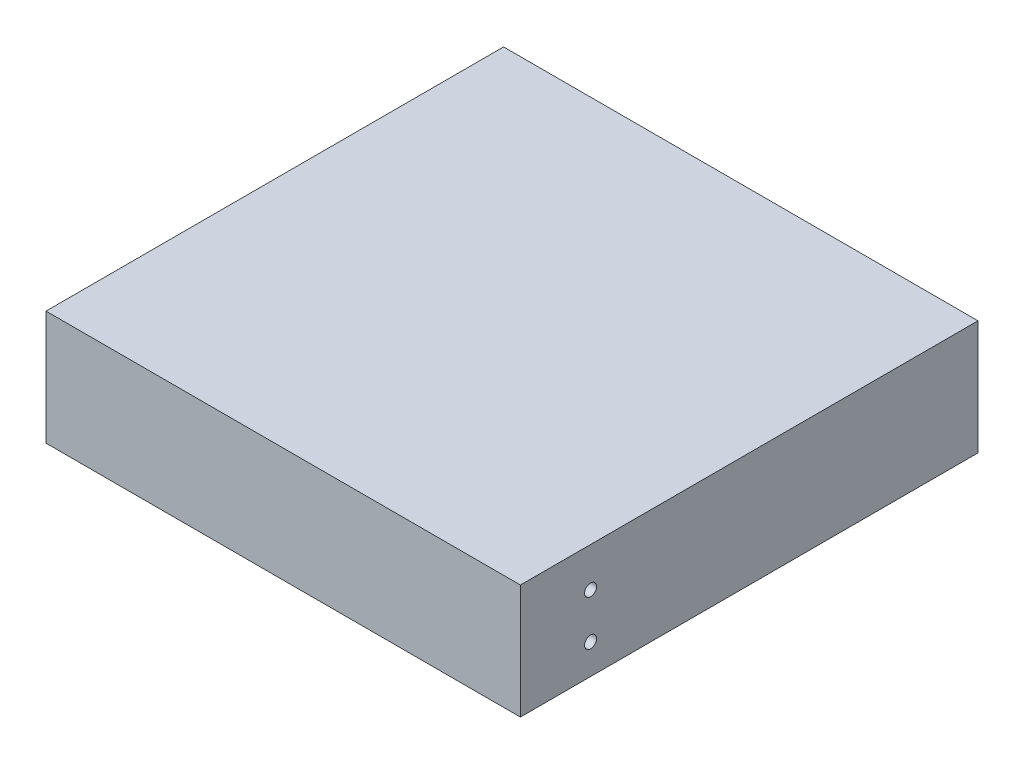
ISO-10303-21;
HEADER;
FILE_DESCRIPTION(('STEP AP214'),'2;1');
FILE_NAME('part.step','',(''),(''),'','','');
FILE_SCHEMA(('AUTOMOTIVE_DESIGN { 1 0 10303 214 1 1 1 1 }'));
ENDSEC;
DATA;
#1=APPLICATION_CONTEXT('core data for automotive mechanical design processes');
#2=APPLICATION_PROTOCOL_DEFINITION('international standard','automotive_design',2000,#1);
#3=PRODUCT_CONTEXT('',#1,'mechanical');
#4=PRODUCT('Part','Part','',(#3));
#5=PRODUCT_RELATED_PRODUCT_CATEGORY('part','',(#4));
#6=PRODUCT_DEFINITION_FORMATION('','',#4);
#7=PRODUCT_DEFINITION_CONTEXT('part definition',#1,'design');
#8=PRODUCT_DEFINITION('design','',#6,#7);
#9=PRODUCT_DEFINITION_SHAPE('','',#8);
#10=(LENGTH_UNIT() NAMED_UNIT(*) SI_UNIT(.MILLI.,.METRE.));
#11=(NAMED_UNIT(*) PLANE_ANGLE_UNIT() SI_UNIT($,.RADIAN.));
#12=(NAMED_UNIT(*) SI_UNIT($,.STERADIAN.) SOLID_ANGLE_UNIT());
#13=UNCERTAINTY_MEASURE_WITH_UNIT(LENGTH_MEASURE(1.E-05),#10,'distance_accuracy_value','');
#14=(GEOMETRIC_REPRESENTATION_CONTEXT(3) GLOBAL_UNCERTAINTY_ASSIGNED_CONTEXT((#13)) GLOBAL_UNIT_ASSIGNED_CONTEXT((#10,
#11,#12)) REPRESENTATION_CONTEXT('',''));
#15=CARTESIAN_POINT('',(0.,0.,0.));
#16=DIRECTION('',(0.,0.,1.));
#17=DIRECTION('',(1.,0.,0.));
#18=AXIS2_PLACEMENT_3D('',#15,#16,#17);
#19=CARTESIAN_POINT('',(-316.,0.,0.));
#20=DIRECTION('',(0.,0.,1.));
#21=DIRECTION('',(1.,0.,0.));
#22=AXIS2_PLACEMENT_3D('',#19,#20,#21);
#23=PLANE('',#22);
#24=DIRECTION('',(0.,-1.,0.));
#25=VECTOR('',#24,1.);
#26=CARTESIAN_POINT('',(0.,0.,0.));
#27=LINE('',#26,#25);
#28=CARTESIAN_POINT('',(0.,76.2,0.));
#29=VERTEX_POINT('',#28);
#30=CARTESIAN_POINT('',(0.,0.,0.));
#31=VERTEX_POINT('',#30);
#32=EDGE_CURVE('E99',#29,#31,#27,.T.);
#33=ORIENTED_EDGE('',*,*,#32,.F.);
#34=DIRECTION('',(1.,0.,0.));
#35=VECTOR('',#34,1.);
#36=CARTESIAN_POINT('',(-316.,76.2,0.));
#37=LINE('',#36,#35);
#38=CARTESIAN_POINT('',(-316.,76.2,0.));
#39=VERTEX_POINT('',#38);
#40=EDGE_CURVE('E11',#39,#29,#37,.T.);
#41=ORIENTED_EDGE('',*,*,#40,.F.);
#42=DIRECTION('',(0.,-1.,0.));
#43=VECTOR('',#42,1.);
#44=CARTESIAN_POINT('',(-316.,0.,0.));
#45=LINE('',#44,#43);
#46=CARTESIAN_POINT('',(-316.,0.,0.));
#47=VERTEX_POINT('',#46);
#48=EDGE_CURVE('E92',#39,#47,#45,.T.);
#49=ORIENTED_EDGE('',*,*,#48,.T.);
#50=DIRECTION('',(1.,0.,0.));
#51=VECTOR('',#50,1.);
#52=CARTESIAN_POINT('',(-316.,0.,0.));
#53=LINE('',#52,#51);
#54=EDGE_CURVE('E37',#47,#31,#53,.T.);
#55=ORIENTED_EDGE('',*,*,#54,.T.);
#56=EDGE_LOOP('',(#33,#41,#49,#55));
#57=FACE_BOUND('',#56,.T.);
#58=ADVANCED_FACE('F34',(#57),#23,.T.);
#59=CARTESIAN_POINT('',(-316.,76.2,0.));
#60=DIRECTION('',(0.,1.,0.));
#61=DIRECTION('',(0.,0.,1.));
#62=AXIS2_PLACEMENT_3D('',#59,#60,#61);
#63=PLANE('',#62);
#64=DIRECTION('',(0.,0.,1.));
#65=VECTOR('',#64,1.);
#66=CARTESIAN_POINT('',(0.,76.2,0.));
#67=LINE('',#66,#65);
#68=CARTESIAN_POINT('',(0.,76.2,-304.8));
#69=VERTEX_POINT('',#68);
#70=EDGE_CURVE('E94',#69,#29,#67,.T.);
#71=ORIENTED_EDGE('',*,*,#70,.F.);
#72=DIRECTION('',(1.,0.,0.));
#73=VECTOR('',#72,1.);
#74=CARTESIAN_POINT('',(-316.,76.2,-304.8));
#75=LINE('',#74,#73);
#76=CARTESIAN_POINT('',(-316.,76.2,-304.8));
#77=VERTEX_POINT('',#76);
#78=EDGE_CURVE('E43',#77,#69,#75,.T.);
#79=ORIENTED_EDGE('',*,*,#78,.F.);
#80=DIRECTION('',(0.,0.,1.));
#81=VECTOR('',#80,1.);
#82=CARTESIAN_POINT('',(-316.,76.2,0.));
#83=LINE('',#82,#81);
#84=EDGE_CURVE('E89',#77,#39,#83,.T.);
#85=ORIENTED_EDGE('',*,*,#84,.T.);
#86=ORIENTED_EDGE('',*,*,#40,.T.);
#87=EDGE_LOOP('',(#71,#79,#85,#86));
#88=FACE_BOUND('',#87,.T.);
#89=ADVANCED_FACE('F110',(#88),#63,.T.);
#90=CARTESIAN_POINT('',(-316.,0.,-304.8));
#91=DIRECTION('',(0.,0.,-1.));
#92=DIRECTION('',(-1.,0.,0.));
#93=AXIS2_PLACEMENT_3D('',#90,#91,#92);
#94=PLANE('',#93);
#95=DIRECTION('',(0.,1.,0.));
#96=VECTOR('',#95,1.);
#97=CARTESIAN_POINT('',(0.,0.,-304.8));
#98=LINE('',#97,#96);
#99=CARTESIAN_POINT('',(0.,0.,-304.8));
#100=VERTEX_POINT('',#99);
#101=EDGE_CURVE('E84',#100,#69,#98,.T.);
#102=ORIENTED_EDGE('',*,*,#101,.F.);
#103=DIRECTION('',(1.,0.,0.));
#104=VECTOR('',#103,1.);
#105=CARTESIAN_POINT('',(-316.,0.,-304.8));
#106=LINE('',#105,#104);
#107=CARTESIAN_POINT('',(-316.,0.,-304.8));
#108=VERTEX_POINT('',#107);
#109=EDGE_CURVE('E79',#108,#100,#106,.T.);
#110=ORIENTED_EDGE('',*,*,#109,.F.);
#111=DIRECTION('',(0.,1.,0.));
#112=VECTOR('',#111,1.);
#113=CARTESIAN_POINT('',(-316.,0.,-304.8));
#114=LINE('',#113,#112);
#115=EDGE_CURVE('E82',#108,#77,#114,.T.);
#116=ORIENTED_EDGE('',*,*,#115,.T.);
#117=ORIENTED_EDGE('',*,*,#78,.T.);
#118=EDGE_LOOP('',(#102,#110,#116,#117));
#119=FACE_BOUND('',#118,.T.);
#120=ADVANCED_FACE('F81',(#119),#94,.T.);
#121=CARTESIAN_POINT('',(-316.,0.,0.));
#122=DIRECTION('',(0.,-1.,0.));
#123=DIRECTION('',(0.,0.,-1.));
#124=AXIS2_PLACEMENT_3D('',#121,#122,#123);
#125=PLANE('',#124);
#126=DIRECTION('',(0.,0.,-1.));
#127=VECTOR('',#126,1.);
#128=CARTESIAN_POINT('',(0.,0.,0.));
#129=LINE('',#128,#127);
#130=EDGE_CURVE('E102',#31,#100,#129,.T.);
#131=ORIENTED_EDGE('',*,*,#130,.F.);
#132=ORIENTED_EDGE('',*,*,#54,.F.);
#133=DIRECTION('',(0.,0.,-1.));
#134=VECTOR('',#133,1.);
#135=CARTESIAN_POINT('',(-316.,0.,0.));
#136=LINE('',#135,#134);
#137=EDGE_CURVE('E88',#47,#108,#136,.T.);
#138=ORIENTED_EDGE('',*,*,#137,.T.);
#139=ORIENTED_EDGE('',*,*,#109,.T.);
#140=EDGE_LOOP('',(#131,#132,#138,#139));
#141=FACE_BOUND('',#140,.T.);
#142=ADVANCED_FACE('F91',(#141),#125,.T.);
#143=CARTESIAN_POINT('',(-316.,76.2,0.));
#144=DIRECTION('',(-1.,0.,0.));
#145=DIRECTION('',(0.,0.,1.));
#146=AXIS2_PLACEMENT_3D('',#143,#144,#145);
#147=PLANE('',#146);
#148=ORIENTED_EDGE('',*,*,#48,.F.);
#149=ORIENTED_EDGE('',*,*,#84,.F.);
#150=ORIENTED_EDGE('',*,*,#115,.F.);
#151=ORIENTED_EDGE('',*,*,#137,.F.);
#152=EDGE_LOOP('',(#148,#149,#150,#151));
#153=FACE_BOUND('',#152,.T.);
#154=ADVANCED_FACE('F87',(#153),#147,.T.);
#155=CARTESIAN_POINT('',(0.,76.2,0.));
#156=DIRECTION('',(-1.,0.,0.));
#157=DIRECTION('',(0.,0.,1.));
#158=AXIS2_PLACEMENT_3D('',#155,#156,#157);
#159=PLANE('',#158);
#160=CARTESIAN_POINT('',(0.,50.,-46.7212476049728));
#161=DIRECTION('',(1.,0.,0.));
#162=DIRECTION('',(0.,0.,-1.));
#163=AXIS2_PLACEMENT_3D('',#160,#161,#162);
#164=CIRCLE('',#163,4.00000000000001);
#165=CARTESIAN_POINT('',(0.,50.,-50.7212476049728));
#166=VERTEX_POINT('',#165);
#167=EDGE_CURVE('E150',#166,#166,#164,.T.);
#168=ORIENTED_EDGE('',*,*,#167,.F.);
#169=EDGE_LOOP('',(#168));
#170=FACE_BOUND('',#169,.T.);
#171=CARTESIAN_POINT('',(0.,20.,-46.7212476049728));
#172=DIRECTION('',(1.,0.,0.));
#173=DIRECTION('',(0.,0.,-1.));
#174=AXIS2_PLACEMENT_3D('',#171,#172,#173);
#175=CIRCLE('',#174,4.00000000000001);
#176=CARTESIAN_POINT('',(0.,20.,-50.7212476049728));
#177=VERTEX_POINT('',#176);
#178=EDGE_CURVE('E149',#177,#177,#175,.T.);
#179=ORIENTED_EDGE('',*,*,#178,.F.);
#180=EDGE_LOOP('',(#179));
#181=FACE_BOUND('',#180,.T.);
#182=ORIENTED_EDGE('',*,*,#32,.T.);
#183=ORIENTED_EDGE('',*,*,#130,.T.);
#184=ORIENTED_EDGE('',*,*,#101,.T.);
#185=ORIENTED_EDGE('',*,*,#70,.T.);
#186=EDGE_LOOP('',(#182,#183,#184,#185));
#187=FACE_BOUND('',#186,.T.);
#188=ADVANCED_FACE('F109',(#170,#181,#187),#159,.F.);
#189=CARTESIAN_POINT('',(-20.,20.,-46.7212476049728));
#190=DIRECTION('',(1.,0.,0.));
#191=DIRECTION('',(0.,0.,-1.));
#192=AXIS2_PLACEMENT_3D('',#189,#190,#191);
#193=CYLINDRICAL_SURFACE('',#192,4.00000000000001);
#194=CARTESIAN_POINT('',(-20.,20.,-46.7212476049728));
#195=DIRECTION('',(1.,0.,0.));
#196=DIRECTION('',(0.,0.,-1.));
#197=AXIS2_PLACEMENT_3D('',#194,#195,#196);
#198=CIRCLE('',#197,4.00000000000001);
#199=CARTESIAN_POINT('',(-20.,20.,-50.7212476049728));
#200=VERTEX_POINT('',#199);
#201=EDGE_CURVE('E103',#200,#200,#198,.T.);
#202=ORIENTED_EDGE('',*,*,#201,.F.);
#203=EDGE_LOOP('',(#202));
#204=FACE_BOUND('',#203,.T.);
#205=ORIENTED_EDGE('',*,*,#178,.T.);
#206=EDGE_LOOP('',(#205));
#207=FACE_BOUND('',#206,.T.);
#208=ADVANCED_FACE('F127',(#204,#207),#193,.F.);
#209=CARTESIAN_POINT('',(-20.,20.,-46.7212476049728));
#210=DIRECTION('',(1.,0.,0.));
#211=DIRECTION('',(0.,0.,-1.));
#212=AXIS2_PLACEMENT_3D('',#209,#210,#211);
#213=PLANE('',#212);
#214=ORIENTED_EDGE('',*,*,#201,.T.);
#215=EDGE_LOOP('',(#214));
#216=FACE_BOUND('',#215,.T.);
#217=ADVANCED_FACE('F132',(#216),#213,.T.);
#218=CARTESIAN_POINT('',(-20.,50.,-46.7212476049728));
#219=DIRECTION('',(1.,0.,0.));
#220=DIRECTION('',(0.,0.,-1.));
#221=AXIS2_PLACEMENT_3D('',#218,#219,#220);
#222=CYLINDRICAL_SURFACE('',#221,4.00000000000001);
#223=CARTESIAN_POINT('',(-20.,50.,-46.7212476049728));
#224=DIRECTION('',(1.,0.,0.));
#225=DIRECTION('',(0.,0.,-1.));
#226=AXIS2_PLACEMENT_3D('',#223,#224,#225);
#227=CIRCLE('',#226,4.00000000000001);
#228=CARTESIAN_POINT('',(-20.,50.,-50.7212476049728));
#229=VERTEX_POINT('',#228);
#230=EDGE_CURVE('E148',#229,#229,#227,.T.);
#231=ORIENTED_EDGE('',*,*,#230,.F.);
#232=EDGE_LOOP('',(#231));
#233=FACE_BOUND('',#232,.T.);
#234=ORIENTED_EDGE('',*,*,#167,.T.);
#235=EDGE_LOOP('',(#234));
#236=FACE_BOUND('',#235,.T.);
#237=ADVANCED_FACE('F136',(#233,#236),#222,.F.);
#238=CARTESIAN_POINT('',(-20.,50.,-46.7212476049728));
#239=DIRECTION('',(1.,0.,0.));
#240=DIRECTION('',(0.,0.,-1.));
#241=AXIS2_PLACEMENT_3D('',#238,#239,#240);
#242=PLANE('',#241);
#243=ORIENTED_EDGE('',*,*,#230,.T.);
#244=EDGE_LOOP('',(#243));
#245=FACE_BOUND('',#244,.T.);
#246=ADVANCED_FACE('F140',(#245),#242,.T.);
#247=CLOSED_SHELL('',(#58,#89,#120,#142,#154,#188,#208,#217,#237,#246));
#248=MANIFOLD_SOLID_BREP('B2',#247);
#249=ADVANCED_BREP_SHAPE_REPRESENTATION('',(#18,#248),#14);
#250=SHAPE_DEFINITION_REPRESENTATION(#9,#249);
ENDSEC;
END-ISO-10303-21;
